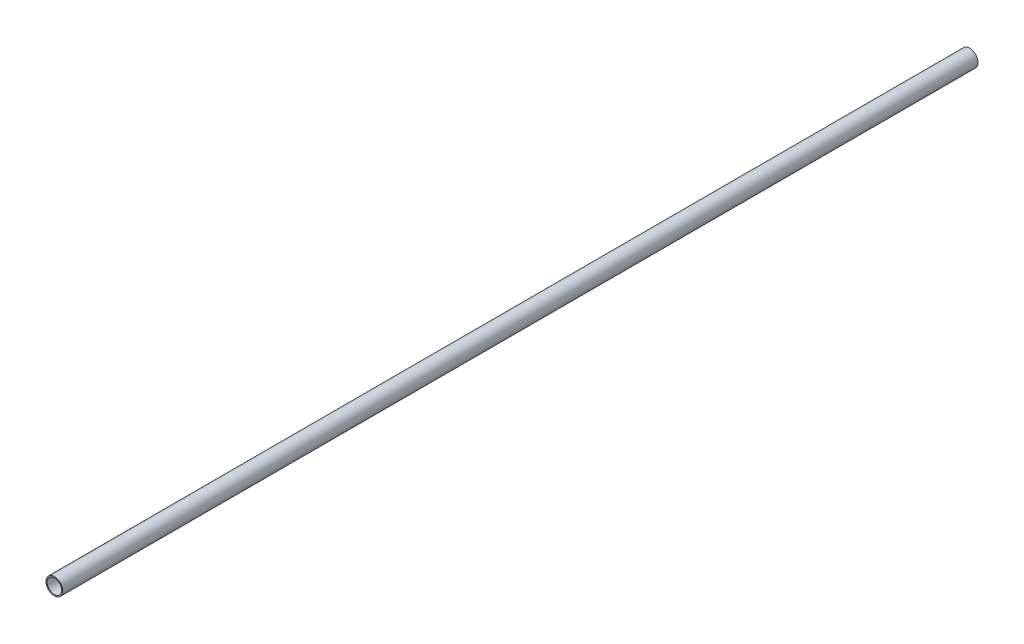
ISO-10303-21;
HEADER;
FILE_DESCRIPTION(('STEP AP214'),'2;1');
FILE_NAME('part.step','',(''),(''),'','','');
FILE_SCHEMA(('AUTOMOTIVE_DESIGN { 1 0 10303 214 1 1 1 1 }'));
ENDSEC;
DATA;
#1=APPLICATION_CONTEXT('core data for automotive mechanical design processes');
#2=APPLICATION_PROTOCOL_DEFINITION('international standard','automotive_design',2000,#1);
#3=PRODUCT_CONTEXT('',#1,'mechanical');
#4=PRODUCT('Part','Part','',(#3));
#5=PRODUCT_RELATED_PRODUCT_CATEGORY('part','',(#4));
#6=PRODUCT_DEFINITION_FORMATION('','',#4);
#7=PRODUCT_DEFINITION_CONTEXT('part definition',#1,'design');
#8=PRODUCT_DEFINITION('design','',#6,#7);
#9=PRODUCT_DEFINITION_SHAPE('','',#8);
#10=(LENGTH_UNIT() NAMED_UNIT(*) SI_UNIT(.MILLI.,.METRE.));
#11=(NAMED_UNIT(*) PLANE_ANGLE_UNIT() SI_UNIT($,.RADIAN.));
#12=(NAMED_UNIT(*) SI_UNIT($,.STERADIAN.) SOLID_ANGLE_UNIT());
#13=UNCERTAINTY_MEASURE_WITH_UNIT(LENGTH_MEASURE(1.E-05),#10,'distance_accuracy_value','');
#14=(GEOMETRIC_REPRESENTATION_CONTEXT(3) GLOBAL_UNCERTAINTY_ASSIGNED_CONTEXT((#13)) GLOBAL_UNIT_ASSIGNED_CONTEXT((#10,
#11,#12)) REPRESENTATION_CONTEXT('',''));
#15=CARTESIAN_POINT('',(0.,0.,0.));
#16=DIRECTION('',(0.,0.,1.));
#17=DIRECTION('',(1.,0.,0.));
#18=AXIS2_PLACEMENT_3D('',#15,#16,#17);
#19=CARTESIAN_POINT('',(0.,0.,1041.4));
#20=DIRECTION('',(0.,0.,1.));
#21=DIRECTION('',(1.,0.,0.));
#22=AXIS2_PLACEMENT_3D('',#19,#20,#21);
#23=PLANE('',#22);
#24=CARTESIAN_POINT('',(0.,0.,1041.4));
#25=DIRECTION('',(0.,0.,1.));
#26=DIRECTION('',(1.,0.,0.));
#27=AXIS2_PLACEMENT_3D('',#24,#25,#26);
#28=CIRCLE('',#27,9.525);
#29=CARTESIAN_POINT('',(9.525,0.,1041.4));
#30=VERTEX_POINT('',#29);
#31=EDGE_CURVE('E10',#30,#30,#28,.T.);
#32=ORIENTED_EDGE('',*,*,#31,.T.);
#33=EDGE_LOOP('',(#32));
#34=FACE_BOUND('',#33,.T.);
#35=CARTESIAN_POINT('',(0.,0.,1041.4));
#36=DIRECTION('',(0.,0.,1.));
#37=DIRECTION('',(1.,0.,0.));
#38=AXIS2_PLACEMENT_3D('',#35,#36,#37);
#39=CIRCLE('',#38,8.255);
#40=CARTESIAN_POINT('',(8.255,0.,1041.4));
#41=VERTEX_POINT('',#40);
#42=EDGE_CURVE('E50',#41,#41,#39,.T.);
#43=ORIENTED_EDGE('',*,*,#42,.F.);
#44=EDGE_LOOP('',(#43));
#45=FACE_BOUND('',#44,.T.);
#46=ADVANCED_FACE('F39',(#34,#45),#23,.T.);
#47=CARTESIAN_POINT('',(0.,0.,0.));
#48=DIRECTION('',(0.,0.,1.));
#49=DIRECTION('',(1.,0.,0.));
#50=AXIS2_PLACEMENT_3D('',#47,#48,#49);
#51=PLANE('',#50);
#52=CARTESIAN_POINT('',(0.,0.,0.));
#53=DIRECTION('',(0.,0.,1.));
#54=DIRECTION('',(1.,0.,0.));
#55=AXIS2_PLACEMENT_3D('',#52,#53,#54);
#56=CIRCLE('',#55,9.525);
#57=CARTESIAN_POINT('',(9.525,0.,0.));
#58=VERTEX_POINT('',#57);
#59=EDGE_CURVE('E43',#58,#58,#56,.T.);
#60=ORIENTED_EDGE('',*,*,#59,.F.);
#61=EDGE_LOOP('',(#60));
#62=FACE_BOUND('',#61,.T.);
#63=CARTESIAN_POINT('',(0.,0.,0.));
#64=DIRECTION('',(0.,0.,1.));
#65=DIRECTION('',(1.,0.,0.));
#66=AXIS2_PLACEMENT_3D('',#63,#64,#65);
#67=CIRCLE('',#66,8.255);
#68=CARTESIAN_POINT('',(8.255,0.,0.));
#69=VERTEX_POINT('',#68);
#70=EDGE_CURVE('E52',#69,#69,#67,.T.);
#71=ORIENTED_EDGE('',*,*,#70,.T.);
#72=EDGE_LOOP('',(#71));
#73=FACE_BOUND('',#72,.T.);
#74=ADVANCED_FACE('F62',(#62,#73),#51,.F.);
#75=CARTESIAN_POINT('',(0.,0.,1041.4));
#76=DIRECTION('',(0.,0.,-1.));
#77=DIRECTION('',(-1.,0.,0.));
#78=AXIS2_PLACEMENT_3D('',#75,#76,#77);
#79=CYLINDRICAL_SURFACE('',#78,9.525);
#80=ORIENTED_EDGE('',*,*,#31,.F.);
#81=EDGE_LOOP('',(#80));
#82=FACE_BOUND('',#81,.T.);
#83=ORIENTED_EDGE('',*,*,#59,.T.);
#84=EDGE_LOOP('',(#83));
#85=FACE_BOUND('',#84,.T.);
#86=ADVANCED_FACE('F41',(#82,#85),#79,.T.);
#87=CARTESIAN_POINT('',(0.,0.,1041.4));
#88=DIRECTION('',(0.,0.,-1.));
#89=DIRECTION('',(-1.,0.,0.));
#90=AXIS2_PLACEMENT_3D('',#87,#88,#89);
#91=CYLINDRICAL_SURFACE('',#90,8.255);
#92=ORIENTED_EDGE('',*,*,#42,.T.);
#93=EDGE_LOOP('',(#92));
#94=FACE_BOUND('',#93,.T.);
#95=ORIENTED_EDGE('',*,*,#70,.F.);
#96=EDGE_LOOP('',(#95));
#97=FACE_BOUND('',#96,.T.);
#98=ADVANCED_FACE('F58',(#94,#97),#91,.F.);
#99=CLOSED_SHELL('',(#46,#74,#86,#98));
#100=MANIFOLD_SOLID_BREP('B2',#99);
#101=ADVANCED_BREP_SHAPE_REPRESENTATION('',(#18,#100),#14);
#102=SHAPE_DEFINITION_REPRESENTATION(#9,#101);
ENDSEC;
END-ISO-10303-21;
